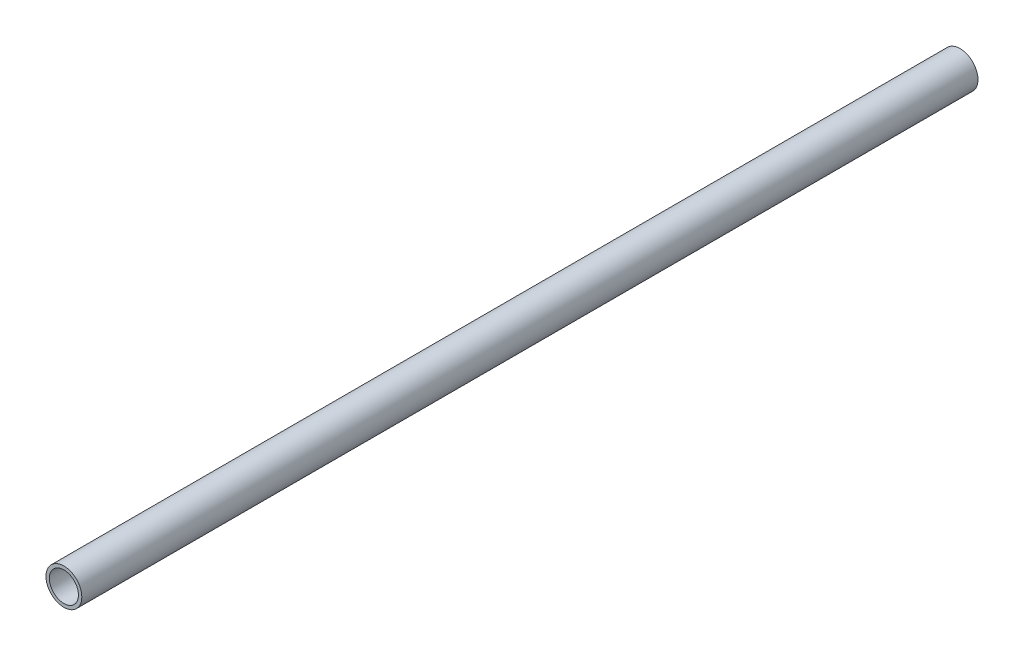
ISO-10303-21;
HEADER;
FILE_DESCRIPTION(('STEP AP214'),'2;1');
FILE_NAME('part.step','',(''),(''),'','','');
FILE_SCHEMA(('AUTOMOTIVE_DESIGN { 1 0 10303 214 1 1 1 1 }'));
ENDSEC;
DATA;
#1=APPLICATION_CONTEXT('core data for automotive mechanical design processes');
#2=APPLICATION_PROTOCOL_DEFINITION('international standard','automotive_design',2000,#1);
#3=PRODUCT_CONTEXT('',#1,'mechanical');
#4=PRODUCT('Part','Part','',(#3));
#5=PRODUCT_RELATED_PRODUCT_CATEGORY('part','',(#4));
#6=PRODUCT_DEFINITION_FORMATION('','',#4);
#7=PRODUCT_DEFINITION_CONTEXT('part definition',#1,'design');
#8=PRODUCT_DEFINITION('design','',#6,#7);
#9=PRODUCT_DEFINITION_SHAPE('','',#8);
#10=(LENGTH_UNIT() NAMED_UNIT(*) SI_UNIT(.MILLI.,.METRE.));
#11=(NAMED_UNIT(*) PLANE_ANGLE_UNIT() SI_UNIT($,.RADIAN.));
#12=(NAMED_UNIT(*) SI_UNIT($,.STERADIAN.) SOLID_ANGLE_UNIT());
#13=UNCERTAINTY_MEASURE_WITH_UNIT(LENGTH_MEASURE(1.E-05),#10,'distance_accuracy_value','');
#14=(GEOMETRIC_REPRESENTATION_CONTEXT(3) GLOBAL_UNCERTAINTY_ASSIGNED_CONTEXT((#13)) GLOBAL_UNIT_ASSIGNED_CONTEXT((#10,
#11,#12)) REPRESENTATION_CONTEXT('',''));
#15=CARTESIAN_POINT('',(0.,0.,0.));
#16=DIRECTION('',(0.,0.,1.));
#17=DIRECTION('',(1.,0.,0.));
#18=AXIS2_PLACEMENT_3D('',#15,#16,#17);
#19=CARTESIAN_POINT('',(0.,0.,400.));
#20=DIRECTION('',(0.,0.,1.));
#21=DIRECTION('',(1.,0.,0.));
#22=AXIS2_PLACEMENT_3D('',#19,#20,#21);
#23=PLANE('',#22);
#24=CARTESIAN_POINT('',(0.,0.,400.));
#25=DIRECTION('',(0.,0.,1.));
#26=DIRECTION('',(1.,0.,0.));
#27=AXIS2_PLACEMENT_3D('',#24,#25,#26);
#28=CIRCLE('',#27,8.);
#29=CARTESIAN_POINT('',(8.,0.,400.));
#30=VERTEX_POINT('',#29);
#31=EDGE_CURVE('E10',#30,#30,#28,.T.);
#32=ORIENTED_EDGE('',*,*,#31,.T.);
#33=EDGE_LOOP('',(#32));
#34=FACE_BOUND('',#33,.T.);
#35=CARTESIAN_POINT('',(0.,0.,400.));
#36=DIRECTION('',(0.,0.,1.));
#37=DIRECTION('',(1.,0.,0.));
#38=AXIS2_PLACEMENT_3D('',#35,#36,#37);
#39=CIRCLE('',#38,6.5);
#40=CARTESIAN_POINT('',(6.5,0.,400.));
#41=VERTEX_POINT('',#40);
#42=EDGE_CURVE('E50',#41,#41,#39,.T.);
#43=ORIENTED_EDGE('',*,*,#42,.F.);
#44=EDGE_LOOP('',(#43));
#45=FACE_BOUND('',#44,.T.);
#46=ADVANCED_FACE('F37',(#34,#45),#23,.T.);
#47=CARTESIAN_POINT('',(0.,0.,0.));
#48=DIRECTION('',(0.,0.,1.));
#49=DIRECTION('',(1.,0.,0.));
#50=AXIS2_PLACEMENT_3D('',#47,#48,#49);
#51=PLANE('',#50);
#52=CARTESIAN_POINT('',(0.,0.,0.));
#53=DIRECTION('',(0.,0.,1.));
#54=DIRECTION('',(1.,0.,0.));
#55=AXIS2_PLACEMENT_3D('',#52,#53,#54);
#56=CIRCLE('',#55,8.);
#57=CARTESIAN_POINT('',(8.,0.,0.));
#58=VERTEX_POINT('',#57);
#59=EDGE_CURVE('E41',#58,#58,#56,.T.);
#60=ORIENTED_EDGE('',*,*,#59,.F.);
#61=EDGE_LOOP('',(#60));
#62=FACE_BOUND('',#61,.T.);
#63=CARTESIAN_POINT('',(0.,0.,0.));
#64=DIRECTION('',(0.,0.,1.));
#65=DIRECTION('',(1.,0.,0.));
#66=AXIS2_PLACEMENT_3D('',#63,#64,#65);
#67=CIRCLE('',#66,6.5);
#68=CARTESIAN_POINT('',(6.5,0.,0.));
#69=VERTEX_POINT('',#68);
#70=EDGE_CURVE('E52',#69,#69,#67,.T.);
#71=ORIENTED_EDGE('',*,*,#70,.T.);
#72=EDGE_LOOP('',(#71));
#73=FACE_BOUND('',#72,.T.);
#74=ADVANCED_FACE('F64',(#62,#73),#51,.F.);
#75=CARTESIAN_POINT('',(0.,0.,400.));
#76=DIRECTION('',(0.,0.,-1.));
#77=DIRECTION('',(-1.,0.,0.));
#78=AXIS2_PLACEMENT_3D('',#75,#76,#77);
#79=CYLINDRICAL_SURFACE('',#78,8.);
#80=ORIENTED_EDGE('',*,*,#31,.F.);
#81=EDGE_LOOP('',(#80));
#82=FACE_BOUND('',#81,.T.);
#83=ORIENTED_EDGE('',*,*,#59,.T.);
#84=EDGE_LOOP('',(#83));
#85=FACE_BOUND('',#84,.T.);
#86=ADVANCED_FACE('F39',(#82,#85),#79,.T.);
#87=CARTESIAN_POINT('',(0.,0.,400.));
#88=DIRECTION('',(0.,0.,-1.));
#89=DIRECTION('',(-1.,0.,0.));
#90=AXIS2_PLACEMENT_3D('',#87,#88,#89);
#91=CYLINDRICAL_SURFACE('',#90,6.5);
#92=ORIENTED_EDGE('',*,*,#42,.T.);
#93=EDGE_LOOP('',(#92));
#94=FACE_BOUND('',#93,.T.);
#95=ORIENTED_EDGE('',*,*,#70,.F.);
#96=EDGE_LOOP('',(#95));
#97=FACE_BOUND('',#96,.T.);
#98=ADVANCED_FACE('F60',(#94,#97),#91,.F.);
#99=CLOSED_SHELL('',(#46,#74,#86,#98));
#100=MANIFOLD_SOLID_BREP('B2',#99);
#101=ADVANCED_BREP_SHAPE_REPRESENTATION('',(#18,#100),#14);
#102=SHAPE_DEFINITION_REPRESENTATION(#9,#101);
ENDSEC;
END-ISO-10303-21;
